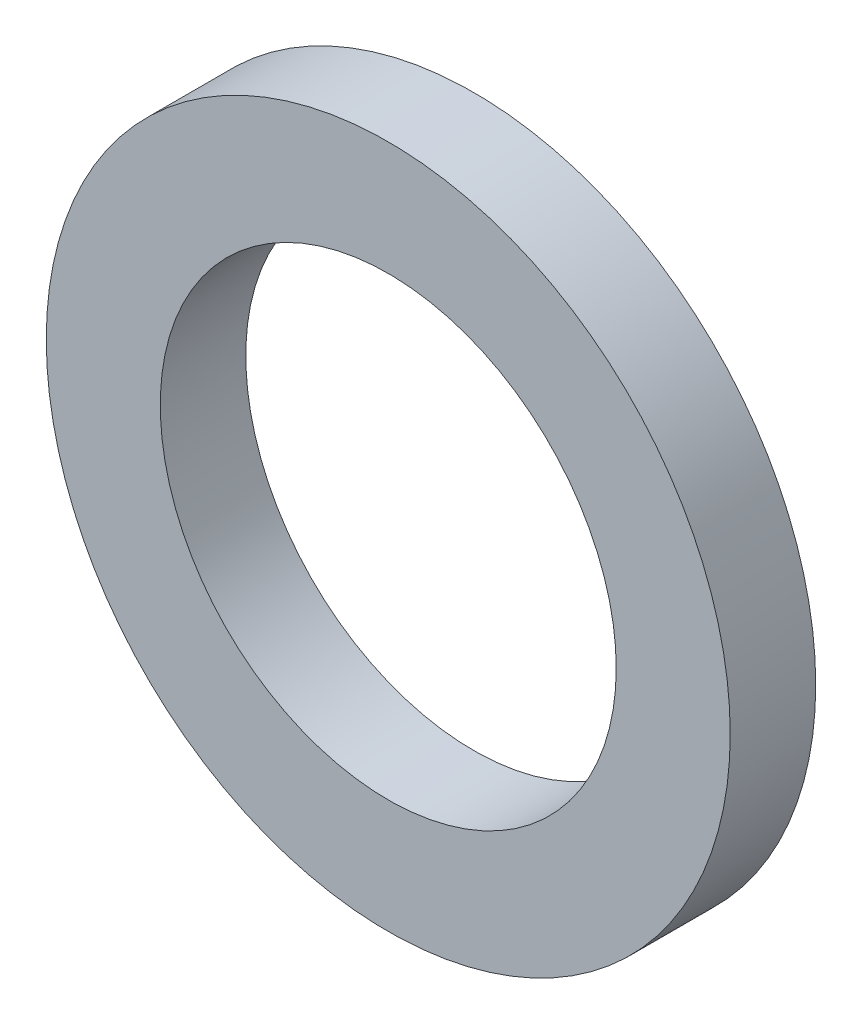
ISO-10303-21;
HEADER;
FILE_DESCRIPTION(('STEP AP214'),'2;1');
FILE_NAME('part.step','',(''),(''),'','','');
FILE_SCHEMA(('AUTOMOTIVE_DESIGN { 1 0 10303 214 1 1 1 1 }'));
ENDSEC;
DATA;
#1=APPLICATION_CONTEXT('core data for automotive mechanical design processes');
#2=APPLICATION_PROTOCOL_DEFINITION('international standard','automotive_design',2000,#1);
#3=PRODUCT_CONTEXT('',#1,'mechanical');
#4=PRODUCT('Part','Part','',(#3));
#5=PRODUCT_RELATED_PRODUCT_CATEGORY('part','',(#4));
#6=PRODUCT_DEFINITION_FORMATION('','',#4);
#7=PRODUCT_DEFINITION_CONTEXT('part definition',#1,'design');
#8=PRODUCT_DEFINITION('design','',#6,#7);
#9=PRODUCT_DEFINITION_SHAPE('','',#8);
#10=(LENGTH_UNIT() NAMED_UNIT(*) SI_UNIT(.MILLI.,.METRE.));
#11=(NAMED_UNIT(*) PLANE_ANGLE_UNIT() SI_UNIT($,.RADIAN.));
#12=(NAMED_UNIT(*) SI_UNIT($,.STERADIAN.) SOLID_ANGLE_UNIT());
#13=UNCERTAINTY_MEASURE_WITH_UNIT(LENGTH_MEASURE(1.E-05),#10,'distance_accuracy_value','');
#14=(GEOMETRIC_REPRESENTATION_CONTEXT(3) GLOBAL_UNCERTAINTY_ASSIGNED_CONTEXT((#13)) GLOBAL_UNIT_ASSIGNED_CONTEXT((#10,
#11,#12)) REPRESENTATION_CONTEXT('',''));
#15=CARTESIAN_POINT('',(0.,0.,0.));
#16=DIRECTION('',(0.,0.,1.));
#17=DIRECTION('',(1.,0.,0.));
#18=AXIS2_PLACEMENT_3D('',#15,#16,#17);
#19=CARTESIAN_POINT('',(0.,0.,1.5));
#20=DIRECTION('',(0.,0.,-1.));
#21=DIRECTION('',(1.,0.,0.));
#22=AXIS2_PLACEMENT_3D('',#19,#20,#21);
#23=CYLINDRICAL_SURFACE('',#22,12.);
#24=CARTESIAN_POINT('',(0.,0.,3.));
#25=DIRECTION('',(0.,0.,1.));
#26=DIRECTION('',(1.,0.,0.));
#27=AXIS2_PLACEMENT_3D('',#24,#25,#26);
#28=CIRCLE('',#27,12.);
#29=CARTESIAN_POINT('',(12.,0.,3.));
#30=VERTEX_POINT('',#29);
#31=EDGE_CURVE('E24',#30,#30,#28,.T.);
#32=ORIENTED_EDGE('',*,*,#31,.F.);
#33=EDGE_LOOP('',(#32));
#34=FACE_BOUND('',#33,.T.);
#35=CARTESIAN_POINT('',(0.,0.,0.));
#36=DIRECTION('',(0.,0.,1.));
#37=DIRECTION('',(1.,0.,0.));
#38=AXIS2_PLACEMENT_3D('',#35,#36,#37);
#39=CIRCLE('',#38,12.);
#40=CARTESIAN_POINT('',(12.,0.,0.));
#41=VERTEX_POINT('',#40);
#42=EDGE_CURVE('E11',#41,#41,#39,.T.);
#43=ORIENTED_EDGE('',*,*,#42,.T.);
#44=EDGE_LOOP('',(#43));
#45=FACE_BOUND('',#44,.T.);
#46=ADVANCED_FACE('F16',(#34,#45),#23,.T.);
#47=CARTESIAN_POINT('',(10.,0.,3.));
#48=DIRECTION('',(0.,0.,1.));
#49=DIRECTION('',(1.,0.,0.));
#50=AXIS2_PLACEMENT_3D('',#47,#48,#49);
#51=PLANE('',#50);
#52=CARTESIAN_POINT('',(0.,0.,3.));
#53=DIRECTION('',(0.,0.,1.));
#54=DIRECTION('',(1.,0.,0.));
#55=AXIS2_PLACEMENT_3D('',#52,#53,#54);
#56=CIRCLE('',#55,8.);
#57=CARTESIAN_POINT('',(8.,0.,3.));
#58=VERTEX_POINT('',#57);
#59=EDGE_CURVE('E19',#58,#58,#56,.T.);
#60=ORIENTED_EDGE('',*,*,#59,.F.);
#61=EDGE_LOOP('',(#60));
#62=FACE_BOUND('',#61,.T.);
#63=ORIENTED_EDGE('',*,*,#31,.T.);
#64=EDGE_LOOP('',(#63));
#65=FACE_BOUND('',#64,.T.);
#66=ADVANCED_FACE('F47',(#62,#65),#51,.T.);
#67=CARTESIAN_POINT('',(0.,0.,1.5));
#68=DIRECTION('',(0.,0.,-1.));
#69=DIRECTION('',(1.,0.,0.));
#70=AXIS2_PLACEMENT_3D('',#67,#68,#69);
#71=CYLINDRICAL_SURFACE('',#70,8.);
#72=CARTESIAN_POINT('',(0.,0.,0.));
#73=DIRECTION('',(0.,0.,1.));
#74=DIRECTION('',(1.,0.,0.));
#75=AXIS2_PLACEMENT_3D('',#72,#73,#74);
#76=CIRCLE('',#75,8.);
#77=CARTESIAN_POINT('',(8.,0.,0.));
#78=VERTEX_POINT('',#77);
#79=EDGE_CURVE('E39',#78,#78,#76,.T.);
#80=ORIENTED_EDGE('',*,*,#79,.F.);
#81=EDGE_LOOP('',(#80));
#82=FACE_BOUND('',#81,.T.);
#83=ORIENTED_EDGE('',*,*,#59,.T.);
#84=EDGE_LOOP('',(#83));
#85=FACE_BOUND('',#84,.T.);
#86=ADVANCED_FACE('F40',(#82,#85),#71,.F.);
#87=CARTESIAN_POINT('',(10.,0.,0.));
#88=DIRECTION('',(0.,0.,-1.));
#89=DIRECTION('',(-1.,0.,0.));
#90=AXIS2_PLACEMENT_3D('',#87,#88,#89);
#91=PLANE('',#90);
#92=ORIENTED_EDGE('',*,*,#42,.F.);
#93=EDGE_LOOP('',(#92));
#94=FACE_BOUND('',#93,.T.);
#95=ORIENTED_EDGE('',*,*,#79,.T.);
#96=EDGE_LOOP('',(#95));
#97=FACE_BOUND('',#96,.T.);
#98=ADVANCED_FACE('F56',(#94,#97),#91,.T.);
#99=CLOSED_SHELL('',(#46,#66,#86,#98));
#100=MANIFOLD_SOLID_BREP('B1',#99);
#101=ADVANCED_BREP_SHAPE_REPRESENTATION('',(#18,#100),#14);
#102=SHAPE_DEFINITION_REPRESENTATION(#9,#101);
ENDSEC;
END-ISO-10303-21;
